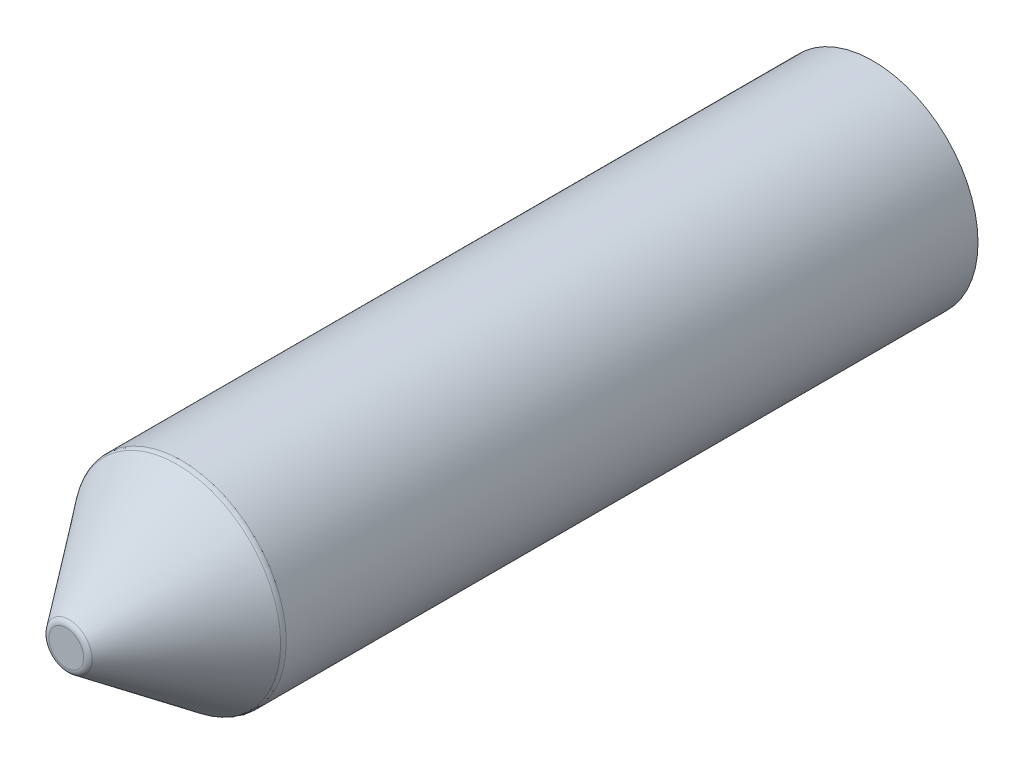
ISO-10303-21;
HEADER;
FILE_DESCRIPTION(('STEP AP214'),'2;1');
FILE_NAME('part.step','',(''),(''),'','','');
FILE_SCHEMA(('AUTOMOTIVE_DESIGN { 1 0 10303 214 1 1 1 1 }'));
ENDSEC;
DATA;
#1=APPLICATION_CONTEXT('core data for automotive mechanical design processes');
#2=APPLICATION_PROTOCOL_DEFINITION('international standard','automotive_design',2000,#1);
#3=PRODUCT_CONTEXT('',#1,'mechanical');
#4=PRODUCT('Part','Part','',(#3));
#5=PRODUCT_RELATED_PRODUCT_CATEGORY('part','',(#4));
#6=PRODUCT_DEFINITION_FORMATION('','',#4);
#7=PRODUCT_DEFINITION_CONTEXT('part definition',#1,'design');
#8=PRODUCT_DEFINITION('design','',#6,#7);
#9=PRODUCT_DEFINITION_SHAPE('','',#8);
#10=(LENGTH_UNIT() NAMED_UNIT(*) SI_UNIT(.MILLI.,.METRE.));
#11=(NAMED_UNIT(*) PLANE_ANGLE_UNIT() SI_UNIT($,.RADIAN.));
#12=(NAMED_UNIT(*) SI_UNIT($,.STERADIAN.) SOLID_ANGLE_UNIT());
#13=UNCERTAINTY_MEASURE_WITH_UNIT(LENGTH_MEASURE(1.E-05),#10,'distance_accuracy_value','');
#14=(GEOMETRIC_REPRESENTATION_CONTEXT(3) GLOBAL_UNCERTAINTY_ASSIGNED_CONTEXT((#13)) GLOBAL_UNIT_ASSIGNED_CONTEXT((#10,
#11,#12)) REPRESENTATION_CONTEXT('',''));
#15=CARTESIAN_POINT('',(0.,0.,0.));
#16=DIRECTION('',(0.,0.,1.));
#17=DIRECTION('',(1.,0.,0.));
#18=AXIS2_PLACEMENT_3D('',#15,#16,#17);
#19=CARTESIAN_POINT('',(0.,0.,114.45));
#20=DIRECTION('',(0.,0.,-1.));
#21=DIRECTION('',(-1.,0.,0.));
#22=AXIS2_PLACEMENT_3D('',#19,#20,#21);
#23=CYLINDRICAL_SURFACE('',#22,14.865);
#24=CARTESIAN_POINT('',(0.,0.,98.1188940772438));
#25=DIRECTION('',(0.,0.,1.));
#26=DIRECTION('',(1.,0.,0.));
#27=AXIS2_PLACEMENT_3D('',#24,#25,#26);
#28=CIRCLE('',#27,14.865);
#29=CARTESIAN_POINT('',(14.865,0.,98.1188940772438));
#30=VERTEX_POINT('',#29);
#31=EDGE_CURVE('E43',#30,#30,#28,.F.);
#32=ORIENTED_EDGE('',*,*,#31,.T.);
#33=EDGE_LOOP('',(#32));
#34=FACE_BOUND('',#33,.T.);
#35=CARTESIAN_POINT('',(0.,0.,0.));
#36=DIRECTION('',(0.,0.,1.));
#37=DIRECTION('',(1.,0.,0.));
#38=AXIS2_PLACEMENT_3D('',#35,#36,#37);
#39=CIRCLE('',#38,14.865);
#40=CARTESIAN_POINT('',(14.865,0.,0.));
#41=VERTEX_POINT('',#40);
#42=EDGE_CURVE('E48',#41,#41,#39,.T.);
#43=ORIENTED_EDGE('',*,*,#42,.T.);
#44=EDGE_LOOP('',(#43));
#45=FACE_BOUND('',#44,.T.);
#46=ADVANCED_FACE('F29',(#34,#45),#23,.T.);
#47=CARTESIAN_POINT('',(0.,0.,114.45));
#48=DIRECTION('',(0.,0.,1.));
#49=DIRECTION('',(1.,0.,0.));
#50=AXIS2_PLACEMENT_3D('',#47,#48,#49);
#51=PLANE('',#50);
#52=CARTESIAN_POINT('',(0.,0.,114.45));
#53=DIRECTION('',(0.,0.,1.));
#54=DIRECTION('',(1.,0.,0.));
#55=AXIS2_PLACEMENT_3D('',#52,#53,#54);
#56=CIRCLE('',#55,2.46248996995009);
#57=CARTESIAN_POINT('',(2.46248996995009,0.,114.45));
#58=VERTEX_POINT('',#57);
#59=EDGE_CURVE('E10',#58,#58,#56,.T.);
#60=ORIENTED_EDGE('',*,*,#59,.T.);
#61=EDGE_LOOP('',(#60));
#62=FACE_BOUND('',#61,.T.);
#63=ADVANCED_FACE('F76',(#62),#51,.T.);
#64=CARTESIAN_POINT('',(0.,0.,0.));
#65=DIRECTION('',(0.,0.,1.));
#66=DIRECTION('',(1.,0.,0.));
#67=AXIS2_PLACEMENT_3D('',#64,#65,#66);
#68=PLANE('',#67);
#69=CARTESIAN_POINT('',(0.,0.,0.));
#70=DIRECTION('',(0.,0.,1.));
#71=DIRECTION('',(1.,0.,0.));
#72=AXIS2_PLACEMENT_3D('',#69,#70,#71);
#73=CIRCLE('',#72,13.865);
#74=CARTESIAN_POINT('',(13.865,0.,0.));
#75=VERTEX_POINT('',#74);
#76=EDGE_CURVE('E52',#75,#75,#73,.T.);
#77=ORIENTED_EDGE('',*,*,#76,.T.);
#78=EDGE_LOOP('',(#77));
#79=FACE_BOUND('',#78,.T.);
#80=ORIENTED_EDGE('',*,*,#42,.F.);
#81=EDGE_LOOP('',(#80));
#82=FACE_BOUND('',#81,.T.);
#83=ADVANCED_FACE('F72',(#79,#82),#68,.F.);
#84=CARTESIAN_POINT('',(0.,0.,114.45));
#85=DIRECTION('',(0.,0.,-1.));
#86=DIRECTION('',(-1.,0.,0.));
#87=AXIS2_PLACEMENT_3D('',#84,#85,#86);
#88=CONICAL_SURFACE('',#87,2.965,0.639489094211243);
#89=CARTESIAN_POINT('',(0.,0.,98.7156796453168));
#90=DIRECTION('',(0.,0.,-1.));
#91=DIRECTION('',(-1.,0.,0.));
#92=AXIS2_PLACEMENT_3D('',#89,#90,#91);
#93=CIRCLE('',#92,14.6674007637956);
#94=CARTESIAN_POINT('',(-14.6674007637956,0.,98.7156796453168));
#95=VERTEX_POINT('',#94);
#96=EDGE_CURVE('E35',#95,#95,#93,.F.);
#97=CARTESIAN_POINT('',(0.,0.,114.046785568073));
#98=DIRECTION('',(0.,0.,1.));
#99=DIRECTION('',(1.,0.,0.));
#100=AXIS2_PLACEMENT_3D('',#97,#98,#99);
#101=CIRCLE('',#100,3.26489073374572);
#102=CARTESIAN_POINT('',(-3.26489073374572,0.,114.046785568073));
#103=VERTEX_POINT('',#102);
#104=EDGE_CURVE('E39',#103,#103,#101,.F.);
#105=CARTESIAN_POINT('',(-14.6674007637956,0.,98.7156796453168));
#106=CARTESIAN_POINT('',(-14.5486246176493,0.,98.8753786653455));
#107=CARTESIAN_POINT('',(-14.4298484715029,0.,99.0350776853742));
#108=CARTESIAN_POINT('',(-14.1922961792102,0.,99.3544757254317));
#109=CARTESIAN_POINT('',(-14.0735200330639,0.,99.5141747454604));
#110=CARTESIAN_POINT('',(-13.8359677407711,0.,99.8335727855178));
#111=CARTESIAN_POINT('',(-13.7171915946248,0.,99.9932718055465));
#112=CARTESIAN_POINT('',(-13.4796393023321,0.,100.312669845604));
#113=CARTESIAN_POINT('',(-13.3608631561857,0.,100.472368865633));
#114=CARTESIAN_POINT('',(-13.123310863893,0.,100.79176690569));
#115=CARTESIAN_POINT('',(-13.0045347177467,0.,100.951465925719));
#116=CARTESIAN_POINT('',(-12.766982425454,0.,101.270863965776));
#117=CARTESIAN_POINT('',(-12.6482062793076,0.,101.430562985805));
#118=CARTESIAN_POINT('',(-12.4106539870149,0.,101.749961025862));
#119=CARTESIAN_POINT('',(-12.2918778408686,0.,101.909660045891));
#120=CARTESIAN_POINT('',(-12.0543255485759,0.,102.229058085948));
#121=CARTESIAN_POINT('',(-11.9355494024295,0.,102.388757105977));
#122=CARTESIAN_POINT('',(-11.6979971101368,0.,102.708155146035));
#123=CARTESIAN_POINT('',(-11.5792209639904,0.,102.867854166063));
#124=CARTESIAN_POINT('',(-11.3416686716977,0.,103.187252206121));
#125=CARTESIAN_POINT('',(-11.2228925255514,0.,103.346951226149));
#126=CARTESIAN_POINT('',(-10.9853402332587,0.,103.666349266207));
#127=CARTESIAN_POINT('',(-10.8665640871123,0.,103.826048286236));
#128=CARTESIAN_POINT('',(-10.6290117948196,0.,104.145446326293));
#129=CARTESIAN_POINT('',(-10.5102356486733,0.,104.305145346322));
#130=CARTESIAN_POINT('',(-10.2726833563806,0.,104.624543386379));
#131=CARTESIAN_POINT('',(-10.1539072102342,0.,104.784242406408));
#132=CARTESIAN_POINT('',(-9.9163549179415,0.,105.103640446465));
#133=CARTESIAN_POINT('',(-9.79757877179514,0.,105.263339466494));
#134=CARTESIAN_POINT('',(-9.56002647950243,0.,105.582737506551));
#135=CARTESIAN_POINT('',(-9.44125033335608,0.,105.74243652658));
#136=CARTESIAN_POINT('',(-9.20369804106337,0.,106.061834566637));
#137=CARTESIAN_POINT('',(-9.08492189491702,0.,106.221533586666));
#138=CARTESIAN_POINT('',(-8.84736960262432,0.,106.540931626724));
#139=CARTESIAN_POINT('',(-8.72859345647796,0.,106.700630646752));
#140=CARTESIAN_POINT('',(-8.49104116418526,0.,107.02002868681));
#141=CARTESIAN_POINT('',(-8.3722650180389,0.,107.179727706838));
#142=CARTESIAN_POINT('',(-8.1347127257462,0.,107.499125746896));
#143=CARTESIAN_POINT('',(-8.01593657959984,0.,107.658824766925));
#144=CARTESIAN_POINT('',(-7.77838428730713,0.,107.978222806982));
#145=CARTESIAN_POINT('',(-7.65960814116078,0.,108.137921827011));
#146=CARTESIAN_POINT('',(-7.42205584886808,0.,108.457319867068));
#147=CARTESIAN_POINT('',(-7.30327970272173,0.,108.617018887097));
#148=CARTESIAN_POINT('',(-7.06572741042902,0.,108.936416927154));
#149=CARTESIAN_POINT('',(-6.94695126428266,0.,109.096115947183));
#150=CARTESIAN_POINT('',(-6.70939897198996,0.,109.41551398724));
#151=CARTESIAN_POINT('',(-6.5906228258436,0.,109.575213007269));
#152=CARTESIAN_POINT('',(-6.3530705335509,0.,109.894611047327));
#153=CARTESIAN_POINT('',(-6.23429438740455,0.,110.054310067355));
#154=CARTESIAN_POINT('',(-5.99674209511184,0.,110.373708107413));
#155=CARTESIAN_POINT('',(-5.87796594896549,0.,110.533407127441));
#156=CARTESIAN_POINT('',(-5.64041365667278,0.,110.852805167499));
#157=CARTESIAN_POINT('',(-5.52163751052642,0.,111.012504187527));
#158=CARTESIAN_POINT('',(-5.28408521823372,0.,111.331902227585));
#159=CARTESIAN_POINT('',(-5.16530907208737,0.,111.491601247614));
#160=CARTESIAN_POINT('',(-4.92775677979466,0.,111.810999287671));
#161=CARTESIAN_POINT('',(-4.80898063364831,0.,111.9706983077));
#162=CARTESIAN_POINT('',(-4.5714283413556,0.,112.290096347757));
#163=CARTESIAN_POINT('',(-4.45265219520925,0.,112.449795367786));
#164=CARTESIAN_POINT('',(-4.21509990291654,0.,112.769193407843));
#165=CARTESIAN_POINT('',(-4.09632375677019,0.,112.928892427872));
#166=CARTESIAN_POINT('',(-3.85877146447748,0.,113.248290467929));
#167=CARTESIAN_POINT('',(-3.73999531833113,0.,113.407989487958));
#168=CARTESIAN_POINT('',(-3.50244302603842,0.,113.727387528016));
#169=CARTESIAN_POINT('',(-3.38366687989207,0.,113.887086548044));
#170=CARTESIAN_POINT('',(-3.26489073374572,0.,114.046785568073));
#171=B_SPLINE_CURVE_WITH_KNOTS('',3,(#105,#106,#107,#108,#109,#110,#111,#112,#113,#114,#115,
#116,#117,#118,#119,#120,#121,#122,#123,#124,#125,#126,#127,#128,#129,#130,#131,#132,#133,#134,
#135,#136,#137,#138,#139,#140,#141,#142,#143,#144,#145,#146,#147,#148,#149,#150,#151,#152,#153,
#154,#155,#156,#157,#158,#159,#160,#161,#162,#163,#164,#165,#166,#167,#168,#169,#170),
.UNSPECIFIED.,.F.,.F.,(4,2,2,2,2,2,2,2,2,2,2,2,2,2,2,2,2,2,2,2,2,2,2,2,2,2,2,2,2,2,2,2,4),(0.,
0.597079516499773,1.19415903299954,1.7912385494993,2.38831806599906,2.98539758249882,
3.5824770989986,4.17955661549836,4.77663613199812,5.37371564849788,5.97079516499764,
6.56787468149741,7.16495419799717,7.76203371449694,8.3591132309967,8.95619274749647,
9.55327226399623,10.150351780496,10.7474312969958,11.3445108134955,11.9415903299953,
12.538669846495,13.1357493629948,13.7328288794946,14.3299083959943,14.9269879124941,
15.5240674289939,16.1211469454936,16.7182264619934,17.3153059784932,17.9123854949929,
18.5094650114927,19.1065445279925),.UNSPECIFIED.);
#172=EDGE_CURVE('BSEAM75',#95,#103,#171,.T.);
#173=ORIENTED_EDGE('',*,*,#96,.T.);
#174=ORIENTED_EDGE('',*,*,#104,.T.);
#175=ORIENTED_EDGE('',*,*,#172,.T.);
#176=ORIENTED_EDGE('',*,*,#172,.F.);
#177=EDGE_LOOP('',(#173,#175,#174,#176));
#178=FACE_BOUND('',#177,.T.);
#179=ADVANCED_FACE('F75',(#178),#88,.T.);
#180=CARTESIAN_POINT('',(0.,0.,98.1188940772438));
#181=DIRECTION('',(0.,0.,1.));
#182=DIRECTION('',(1.,0.,0.));
#183=AXIS2_PLACEMENT_3D('',#180,#181,#182);
#184=TOROIDAL_SURFACE('',#183,13.865,1.);
#185=ORIENTED_EDGE('',*,*,#96,.F.);
#186=EDGE_LOOP('',(#185));
#187=FACE_BOUND('',#186,.T.);
#188=ORIENTED_EDGE('',*,*,#31,.F.);
#189=EDGE_LOOP('',(#188));
#190=FACE_BOUND('',#189,.T.);
#191=ADVANCED_FACE('F87',(#187,#190),#184,.T.);
#192=CARTESIAN_POINT('',(0.,0.,113.45));
#193=DIRECTION('',(0.,0.,1.));
#194=DIRECTION('',(1.,0.,0.));
#195=AXIS2_PLACEMENT_3D('',#192,#193,#194);
#196=TOROIDAL_SURFACE('',#195,2.46248996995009,1.);
#197=ORIENTED_EDGE('',*,*,#104,.F.);
#198=EDGE_LOOP('',(#197));
#199=FACE_BOUND('',#198,.T.);
#200=ORIENTED_EDGE('',*,*,#59,.F.);
#201=EDGE_LOOP('',(#200));
#202=FACE_BOUND('',#201,.T.);
#203=ADVANCED_FACE('F68',(#199,#202),#196,.T.);
#204=CARTESIAN_POINT('',(0.,0.,114.45));
#205=DIRECTION('',(0.,0.,-1.));
#206=DIRECTION('',(-1.,0.,0.));
#207=AXIS2_PLACEMENT_3D('',#204,#205,#206);
#208=CYLINDRICAL_SURFACE('',#207,13.865);
#209=CARTESIAN_POINT('',(0.,0.,98.1188940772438));
#210=DIRECTION('',(0.,0.,-1.));
#211=DIRECTION('',(-1.,0.,0.));
#212=AXIS2_PLACEMENT_3D('',#209,#210,#211);
#213=CIRCLE('',#212,13.865);
#214=CARTESIAN_POINT('',(-13.865,0.,98.1188940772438));
#215=VERTEX_POINT('',#214);
#216=EDGE_CURVE('E55',#215,#215,#213,.T.);
#217=ORIENTED_EDGE('',*,*,#216,.F.);
#218=EDGE_LOOP('',(#217));
#219=FACE_BOUND('',#218,.T.);
#220=ORIENTED_EDGE('',*,*,#76,.F.);
#221=EDGE_LOOP('',(#220));
#222=FACE_BOUND('',#221,.T.);
#223=ADVANCED_FACE('F64',(#219,#222),#208,.F.);
#224=CARTESIAN_POINT('',(0.,0.,113.45));
#225=DIRECTION('',(0.,0.,1.));
#226=DIRECTION('',(1.,0.,0.));
#227=AXIS2_PLACEMENT_3D('',#224,#225,#226);
#228=PLANE('',#227);
#229=CARTESIAN_POINT('',(0.,0.,113.45));
#230=DIRECTION('',(0.,0.,1.));
#231=DIRECTION('',(1.,0.,0.));
#232=AXIS2_PLACEMENT_3D('',#229,#230,#231);
#233=CIRCLE('',#232,2.46248996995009);
#234=CARTESIAN_POINT('',(-2.4624899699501,0.,113.45));
#235=VERTEX_POINT('',#234);
#236=EDGE_CURVE('E51',#235,#235,#233,.T.);
#237=ORIENTED_EDGE('',*,*,#236,.F.);
#238=EDGE_LOOP('',(#237));
#239=FACE_BOUND('',#238,.T.);
#240=ADVANCED_FACE('F67',(#239),#228,.F.);
#241=CARTESIAN_POINT('',(0.,0.,113.853214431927));
#242=DIRECTION('',(0.,0.,-1.));
#243=DIRECTION('',(-1.,0.,0.));
#244=AXIS2_PLACEMENT_3D('',#241,#242,#243);
#245=CONICAL_SURFACE('',#244,2.16259923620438,0.639489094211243);
#246=CARTESIAN_POINT('',(-13.865,0.,98.1188940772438));
#247=CARTESIAN_POINT('',(-13.7462238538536,0.,98.2785930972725));
#248=CARTESIAN_POINT('',(-13.6274477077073,0.,98.4382921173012));
#249=CARTESIAN_POINT('',(-13.3898954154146,0.,98.7576901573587));
#250=CARTESIAN_POINT('',(-13.2711192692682,0.,98.9173891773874));
#251=CARTESIAN_POINT('',(-13.0335669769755,0.,99.2367872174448));
#252=CARTESIAN_POINT('',(-12.9147908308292,0.,99.3964862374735));
#253=CARTESIAN_POINT('',(-12.6772385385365,0.,99.7158842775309));
#254=CARTESIAN_POINT('',(-12.5584623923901,0.,99.8755832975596));
#255=CARTESIAN_POINT('',(-12.3209101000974,0.,100.194981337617));
#256=CARTESIAN_POINT('',(-12.2021339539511,0.,100.354680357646));
#257=CARTESIAN_POINT('',(-11.9645816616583,0.,100.674078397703));
#258=CARTESIAN_POINT('',(-11.845805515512,0.,100.833777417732));
#259=CARTESIAN_POINT('',(-11.6082532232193,0.,101.153175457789));
#260=CARTESIAN_POINT('',(-11.4894770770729,0.,101.312874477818));
#261=CARTESIAN_POINT('',(-11.2519247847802,0.,101.632272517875));
#262=CARTESIAN_POINT('',(-11.1331486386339,0.,101.791971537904));
#263=CARTESIAN_POINT('',(-10.8955963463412,0.,102.111369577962));
#264=CARTESIAN_POINT('',(-10.7768202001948,0.,102.27106859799));
#265=CARTESIAN_POINT('',(-10.5392679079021,0.,102.590466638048));
#266=CARTESIAN_POINT('',(-10.4204917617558,0.,102.750165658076));
#267=CARTESIAN_POINT('',(-10.1829394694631,0.,103.069563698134));
#268=CARTESIAN_POINT('',(-10.0641633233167,0.,103.229262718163));
#269=CARTESIAN_POINT('',(-9.82661103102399,0.,103.54866075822));
#270=CARTESIAN_POINT('',(-9.70783488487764,0.,103.708359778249));
#271=CARTESIAN_POINT('',(-9.47028259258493,0.,104.027757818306));
#272=CARTESIAN_POINT('',(-9.35150644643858,0.,104.187456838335));
#273=CARTESIAN_POINT('',(-9.11395415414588,0.,104.506854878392));
#274=CARTESIAN_POINT('',(-8.99517800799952,0.,104.666553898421));
#275=CARTESIAN_POINT('',(-8.75762571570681,0.,104.985951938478));
#276=CARTESIAN_POINT('',(-8.63884956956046,0.,105.145650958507));
#277=CARTESIAN_POINT('',(-8.40129727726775,0.,105.465048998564));
#278=CARTESIAN_POINT('',(-8.2825211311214,0.,105.624748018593));
#279=CARTESIAN_POINT('',(-8.04496883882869,0.,105.944146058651));
#280=CARTESIAN_POINT('',(-7.92619269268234,0.,106.103845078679));
#281=CARTESIAN_POINT('',(-7.68864040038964,0.,106.423243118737));
#282=CARTESIAN_POINT('',(-7.56986425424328,0.,106.582942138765));
#283=CARTESIAN_POINT('',(-7.33231196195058,0.,106.902340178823));
#284=CARTESIAN_POINT('',(-7.21353581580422,0.,107.062039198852));
#285=CARTESIAN_POINT('',(-6.97598352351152,0.,107.381437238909));
#286=CARTESIAN_POINT('',(-6.85720737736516,0.,107.541136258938));
#287=CARTESIAN_POINT('',(-6.61965508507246,0.,107.860534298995));
#288=CARTESIAN_POINT('',(-6.5008789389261,0.,108.020233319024));
#289=CARTESIAN_POINT('',(-6.2633266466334,0.,108.339631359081));
#290=CARTESIAN_POINT('',(-6.14455050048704,0.,108.49933037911));
#291=CARTESIAN_POINT('',(-5.90699820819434,0.,108.818728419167));
#292=CARTESIAN_POINT('',(-5.78822206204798,0.,108.978427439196));
#293=CARTESIAN_POINT('',(-5.55066976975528,0.,109.297825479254));
#294=CARTESIAN_POINT('',(-5.43189362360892,0.,109.457524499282));
#295=CARTESIAN_POINT('',(-5.19434133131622,0.,109.77692253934));
#296=CARTESIAN_POINT('',(-5.07556518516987,0.,109.936621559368));
#297=CARTESIAN_POINT('',(-4.83801289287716,0.,110.256019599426));
#298=CARTESIAN_POINT('',(-4.7192367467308,0.,110.415718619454));
#299=CARTESIAN_POINT('',(-4.4816844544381,0.,110.735116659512));
#300=CARTESIAN_POINT('',(-4.36290830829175,0.,110.894815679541));
#301=CARTESIAN_POINT('',(-4.12535601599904,0.,111.214213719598));
#302=CARTESIAN_POINT('',(-4.00657986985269,0.,111.373912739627));
#303=CARTESIAN_POINT('',(-3.76902757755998,0.,111.693310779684));
#304=CARTESIAN_POINT('',(-3.65025143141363,0.,111.853009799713));
#305=CARTESIAN_POINT('',(-3.41269913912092,0.,112.17240783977));
#306=CARTESIAN_POINT('',(-3.29392299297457,0.,112.332106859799));
#307=CARTESIAN_POINT('',(-3.05637070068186,0.,112.651504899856));
#308=CARTESIAN_POINT('',(-2.93759455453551,0.,112.811203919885));
#309=CARTESIAN_POINT('',(-2.7000422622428,0.,113.130601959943));
#310=CARTESIAN_POINT('',(-2.58126611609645,0.,113.290300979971));
#311=CARTESIAN_POINT('',(-2.4624899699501,0.,113.45));
#312=B_SPLINE_CURVE_WITH_KNOTS('',3,(#246,#247,#248,#249,#250,#251,#252,#253,#254,#255,#256,
#257,#258,#259,#260,#261,#262,#263,#264,#265,#266,#267,#268,#269,#270,#271,#272,#273,#274,#275,
#276,#277,#278,#279,#280,#281,#282,#283,#284,#285,#286,#287,#288,#289,#290,#291,#292,#293,#294,
#295,#296,#297,#298,#299,#300,#301,#302,#303,#304,#305,#306,#307,#308,#309,#310,#311),
.UNSPECIFIED.,.F.,.F.,(4,2,2,2,2,2,2,2,2,2,2,2,2,2,2,2,2,2,2,2,2,2,2,2,2,2,2,2,2,2,2,2,4),(0.,
0.597079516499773,1.19415903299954,1.7912385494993,2.38831806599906,2.98539758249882,
3.5824770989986,4.17955661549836,4.77663613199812,5.37371564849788,5.97079516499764,
6.56787468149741,7.16495419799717,7.76203371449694,8.3591132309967,8.95619274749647,
9.55327226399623,10.150351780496,10.7474312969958,11.3445108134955,11.9415903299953,
12.5386698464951,13.1357493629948,13.7328288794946,14.3299083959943,14.9269879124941,
15.5240674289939,16.1211469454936,16.7182264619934,17.3153059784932,17.9123854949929,
18.5094650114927,19.1065445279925),.UNSPECIFIED.);
#313=EDGE_CURVE('BSEAM61',#215,#235,#312,.T.);
#314=ORIENTED_EDGE('',*,*,#216,.T.);
#315=ORIENTED_EDGE('',*,*,#236,.T.);
#316=ORIENTED_EDGE('',*,*,#313,.T.);
#317=ORIENTED_EDGE('',*,*,#313,.F.);
#318=EDGE_LOOP('',(#314,#316,#315,#317));
#319=FACE_BOUND('',#318,.T.);
#320=ADVANCED_FACE('F61',(#319),#245,.F.);
#321=CLOSED_SHELL('',(#46,#63,#83,#179,#191,#203,#223,#240,#320));
#322=MANIFOLD_SOLID_BREP('B2',#321);
#323=ADVANCED_BREP_SHAPE_REPRESENTATION('',(#18,#322),#14);
#324=SHAPE_DEFINITION_REPRESENTATION(#9,#323);
ENDSEC;
END-ISO-10303-21;
